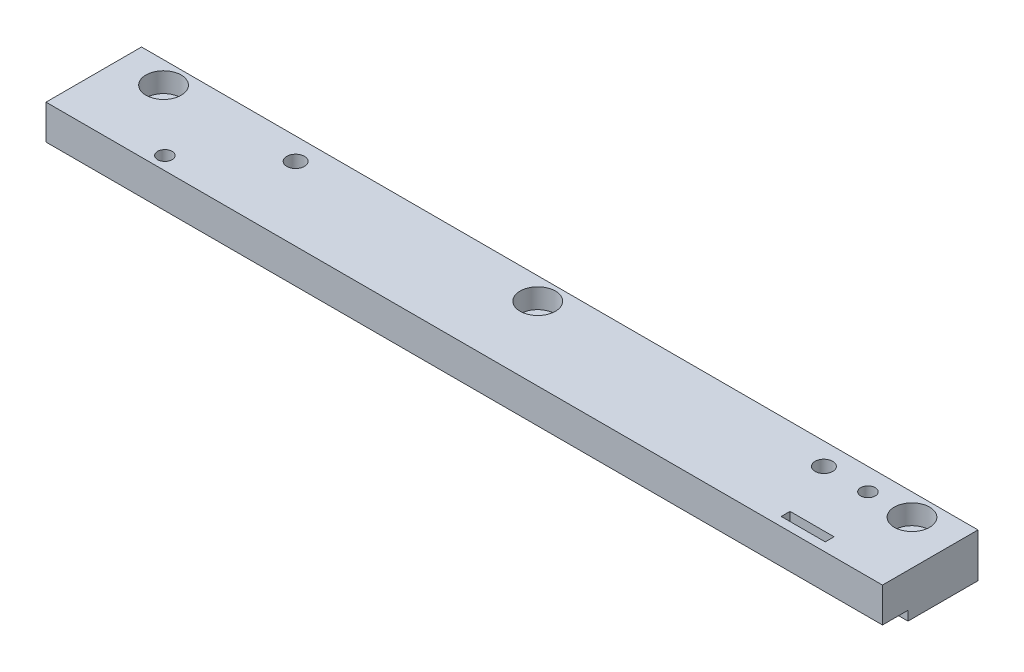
ISO-10303-21;
HEADER;
FILE_DESCRIPTION(('STEP AP214'),'2;1');
FILE_NAME('part.step','',(''),(''),'','','');
FILE_SCHEMA(('AUTOMOTIVE_DESIGN { 1 0 10303 214 1 1 1 1 }'));
ENDSEC;
DATA;
#1=APPLICATION_CONTEXT('core data for automotive mechanical design processes');
#2=APPLICATION_PROTOCOL_DEFINITION('international standard','automotive_design',2000,#1);
#3=PRODUCT_CONTEXT('',#1,'mechanical');
#4=PRODUCT('Part','Part','',(#3));
#5=PRODUCT_RELATED_PRODUCT_CATEGORY('part','',(#4));
#6=PRODUCT_DEFINITION_FORMATION('','',#4);
#7=PRODUCT_DEFINITION_CONTEXT('part definition',#1,'design');
#8=PRODUCT_DEFINITION('design','',#6,#7);
#9=PRODUCT_DEFINITION_SHAPE('','',#8);
#10=(LENGTH_UNIT() NAMED_UNIT(*) SI_UNIT(.MILLI.,.METRE.));
#11=(NAMED_UNIT(*) PLANE_ANGLE_UNIT() SI_UNIT($,.RADIAN.));
#12=(NAMED_UNIT(*) SI_UNIT($,.STERADIAN.) SOLID_ANGLE_UNIT());
#13=UNCERTAINTY_MEASURE_WITH_UNIT(LENGTH_MEASURE(1.E-05),#10,'distance_accuracy_value','');
#14=(GEOMETRIC_REPRESENTATION_CONTEXT(3) GLOBAL_UNCERTAINTY_ASSIGNED_CONTEXT((#13)) GLOBAL_UNIT_ASSIGNED_CONTEXT((#10,
#11,#12)) REPRESENTATION_CONTEXT('',''));
#15=CARTESIAN_POINT('',(0.,0.,0.));
#16=DIRECTION('',(0.,0.,1.));
#17=DIRECTION('',(1.,0.,0.));
#18=AXIS2_PLACEMENT_3D('',#15,#16,#17);
#19=CARTESIAN_POINT('',(180.000000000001,-11.7,5.));
#20=DIRECTION('',(0.,1.,0.));
#21=DIRECTION('',(0.,0.,1.));
#22=AXIS2_PLACEMENT_3D('',#19,#20,#21);
#23=CYLINDRICAL_SURFACE('',#22,2.25);
#24=CARTESIAN_POINT('',(180.000000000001,0.,5.));
#25=DIRECTION('',(0.,1.,0.));
#26=DIRECTION('',(0.,0.,1.));
#27=AXIS2_PLACEMENT_3D('',#24,#25,#26);
#28=CIRCLE('',#27,2.25);
#29=CARTESIAN_POINT('',(180.000000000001,0.,7.25));
#30=VERTEX_POINT('',#29);
#31=EDGE_CURVE('E151',#30,#30,#28,.T.);
#32=ORIENTED_EDGE('',*,*,#31,.F.);
#33=EDGE_LOOP('',(#32));
#34=FACE_BOUND('',#33,.T.);
#35=CARTESIAN_POINT('',(180.000000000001,5.5,5.));
#36=DIRECTION('',(0.,1.,0.));
#37=DIRECTION('',(0.,0.,1.));
#38=AXIS2_PLACEMENT_3D('',#35,#36,#37);
#39=CIRCLE('',#38,2.25);
#40=CARTESIAN_POINT('',(180.000000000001,5.5,7.25));
#41=VERTEX_POINT('',#40);
#42=EDGE_CURVE('E37',#41,#41,#39,.F.);
#43=ORIENTED_EDGE('',*,*,#42,.F.);
#44=EDGE_LOOP('',(#43));
#45=FACE_BOUND('',#44,.T.);
#46=ADVANCED_FACE('F33',(#34,#45),#23,.F.);
#47=CARTESIAN_POINT('',(95.,-11.7,5.));
#48=DIRECTION('',(0.,1.,0.));
#49=DIRECTION('',(0.,0.,1.));
#50=AXIS2_PLACEMENT_3D('',#47,#48,#49);
#51=CYLINDRICAL_SURFACE('',#50,2.25);
#52=CARTESIAN_POINT('',(95.,0.,5.));
#53=DIRECTION('',(0.,1.,0.));
#54=DIRECTION('',(0.,0.,1.));
#55=AXIS2_PLACEMENT_3D('',#52,#53,#54);
#56=CIRCLE('',#55,2.25);
#57=CARTESIAN_POINT('',(95.,0.,7.25));
#58=VERTEX_POINT('',#57);
#59=EDGE_CURVE('E154',#58,#58,#56,.T.);
#60=ORIENTED_EDGE('',*,*,#59,.F.);
#61=EDGE_LOOP('',(#60));
#62=FACE_BOUND('',#61,.T.);
#63=CARTESIAN_POINT('',(95.,5.5,5.));
#64=DIRECTION('',(0.,1.,0.));
#65=DIRECTION('',(0.,0.,1.));
#66=AXIS2_PLACEMENT_3D('',#63,#64,#65);
#67=CIRCLE('',#66,2.25);
#68=CARTESIAN_POINT('',(95.,5.5,7.25));
#69=VERTEX_POINT('',#68);
#70=EDGE_CURVE('E217',#69,#69,#67,.F.);
#71=ORIENTED_EDGE('',*,*,#70,.F.);
#72=EDGE_LOOP('',(#71));
#73=FACE_BOUND('',#72,.T.);
#74=ADVANCED_FACE('F264',(#62,#73),#51,.F.);
#75=CARTESIAN_POINT('',(10.,-11.7,5.));
#76=DIRECTION('',(0.,1.,0.));
#77=DIRECTION('',(0.,0.,1.));
#78=AXIS2_PLACEMENT_3D('',#75,#76,#77);
#79=CYLINDRICAL_SURFACE('',#78,2.25);
#80=CARTESIAN_POINT('',(10.,0.,5.));
#81=DIRECTION('',(0.,1.,0.));
#82=DIRECTION('',(0.,0.,1.));
#83=AXIS2_PLACEMENT_3D('',#80,#81,#82);
#84=CIRCLE('',#83,2.25);
#85=CARTESIAN_POINT('',(10.,0.,7.25));
#86=VERTEX_POINT('',#85);
#87=EDGE_CURVE('E157',#86,#86,#84,.T.);
#88=ORIENTED_EDGE('',*,*,#87,.F.);
#89=EDGE_LOOP('',(#88));
#90=FACE_BOUND('',#89,.T.);
#91=CARTESIAN_POINT('',(10.,5.5,5.));
#92=DIRECTION('',(0.,1.,0.));
#93=DIRECTION('',(0.,0.,1.));
#94=AXIS2_PLACEMENT_3D('',#91,#92,#93);
#95=CIRCLE('',#94,2.25);
#96=CARTESIAN_POINT('',(10.,5.5,7.25));
#97=VERTEX_POINT('',#96);
#98=EDGE_CURVE('E214',#97,#97,#95,.F.);
#99=ORIENTED_EDGE('',*,*,#98,.F.);
#100=EDGE_LOOP('',(#99));
#101=FACE_BOUND('',#100,.T.);
#102=ADVANCED_FACE('F270',(#90,#101),#79,.F.);
#103=CARTESIAN_POINT('',(0.,0.,21.7));
#104=DIRECTION('',(1.,0.,0.));
#105=DIRECTION('',(0.,0.,-1.));
#106=AXIS2_PLACEMENT_3D('',#103,#104,#105);
#107=PLANE('',#106);
#108=DIRECTION('',(0.,-1.,0.));
#109=VECTOR('',#108,1.);
#110=CARTESIAN_POINT('',(0.,0.,15.9000000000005));
#111=LINE('',#110,#109);
#112=CARTESIAN_POINT('',(0.,2.13999999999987,15.9000000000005));
#113=VERTEX_POINT('',#112);
#114=CARTESIAN_POINT('',(0.,0.,15.9000000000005));
#115=VERTEX_POINT('',#114);
#116=EDGE_CURVE('E164',#113,#115,#111,.T.);
#117=ORIENTED_EDGE('',*,*,#116,.F.);
#118=DIRECTION('',(0.,0.,-1.));
#119=VECTOR('',#118,1.);
#120=CARTESIAN_POINT('',(0.,2.13999999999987,21.6999999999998));
#121=LINE('',#120,#119);
#122=CARTESIAN_POINT('',(0.,2.13999999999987,21.6999999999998));
#123=VERTEX_POINT('',#122);
#124=EDGE_CURVE('E161',#123,#113,#121,.T.);
#125=ORIENTED_EDGE('',*,*,#124,.F.);
#126=DIRECTION('',(0.,-1.,0.));
#127=VECTOR('',#126,1.);
#128=CARTESIAN_POINT('',(0.,0.,21.7));
#129=LINE('',#128,#127);
#130=CARTESIAN_POINT('',(0.,10.,21.7));
#131=VERTEX_POINT('',#130);
#132=EDGE_CURVE('E179',#131,#123,#129,.T.);
#133=ORIENTED_EDGE('',*,*,#132,.F.);
#134=DIRECTION('',(0.,0.,-1.));
#135=VECTOR('',#134,1.);
#136=CARTESIAN_POINT('',(0.,10.,21.7));
#137=LINE('',#136,#135);
#138=CARTESIAN_POINT('',(0.,10.,0.));
#139=VERTEX_POINT('',#138);
#140=EDGE_CURVE('E187',#131,#139,#137,.T.);
#141=ORIENTED_EDGE('',*,*,#140,.T.);
#142=DIRECTION('',(0.,-1.,0.));
#143=VECTOR('',#142,1.);
#144=CARTESIAN_POINT('',(0.,0.,0.));
#145=LINE('',#144,#143);
#146=CARTESIAN_POINT('',(0.,0.,0.));
#147=VERTEX_POINT('',#146);
#148=EDGE_CURVE('E174',#139,#147,#145,.T.);
#149=ORIENTED_EDGE('',*,*,#148,.T.);
#150=DIRECTION('',(0.,0.,-1.));
#151=VECTOR('',#150,1.);
#152=CARTESIAN_POINT('',(0.,0.,21.7));
#153=LINE('',#152,#151);
#154=EDGE_CURVE('E203',#115,#147,#153,.T.);
#155=ORIENTED_EDGE('',*,*,#154,.F.);
#156=EDGE_LOOP('',(#117,#125,#133,#141,#149,#155));
#157=FACE_BOUND('',#156,.T.);
#158=ADVANCED_FACE('F35',(#157),#107,.F.);
#159=CARTESIAN_POINT('',(0.,0.,21.7));
#160=DIRECTION('',(0.,1.,0.));
#161=DIRECTION('',(0.,0.,1.));
#162=AXIS2_PLACEMENT_3D('',#159,#160,#161);
#163=PLANE('',#162);
#164=CARTESIAN_POINT('',(170.,0.,5.));
#165=DIRECTION('',(0.,1.,0.));
#166=DIRECTION('',(0.,0.,1.));
#167=AXIS2_PLACEMENT_3D('',#164,#165,#166);
#168=CIRCLE('',#167,1.65000000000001);
#169=CARTESIAN_POINT('',(170.,0.,6.65000000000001));
#170=VERTEX_POINT('',#169);
#171=EDGE_CURVE('E242',#170,#170,#168,.T.);
#172=ORIENTED_EDGE('',*,*,#171,.T.);
#173=EDGE_LOOP('',(#172));
#174=FACE_BOUND('',#173,.T.);
#175=CARTESIAN_POINT('',(160.,0.,5.));
#176=DIRECTION('',(0.,1.,0.));
#177=DIRECTION('',(0.,0.,1.));
#178=AXIS2_PLACEMENT_3D('',#175,#176,#177);
#179=CIRCLE('',#178,2.00000000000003);
#180=CARTESIAN_POINT('',(160.,0.,7.00000000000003));
#181=VERTEX_POINT('',#180);
#182=EDGE_CURVE('E142',#181,#181,#179,.T.);
#183=ORIENTED_EDGE('',*,*,#182,.T.);
#184=EDGE_LOOP('',(#183));
#185=FACE_BOUND('',#184,.T.);
#186=CARTESIAN_POINT('',(40.,0.,5.));
#187=DIRECTION('',(0.,1.,0.));
#188=DIRECTION('',(0.,0.,1.));
#189=AXIS2_PLACEMENT_3D('',#186,#187,#188);
#190=CIRCLE('',#189,2.00000000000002);
#191=CARTESIAN_POINT('',(40.,0.,7.00000000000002));
#192=VERTEX_POINT('',#191);
#193=EDGE_CURVE('E148',#192,#192,#190,.T.);
#194=ORIENTED_EDGE('',*,*,#193,.T.);
#195=EDGE_LOOP('',(#194));
#196=FACE_BOUND('',#195,.T.);
#197=ORIENTED_EDGE('',*,*,#31,.T.);
#198=EDGE_LOOP('',(#197));
#199=FACE_BOUND('',#198,.T.);
#200=ORIENTED_EDGE('',*,*,#59,.T.);
#201=EDGE_LOOP('',(#200));
#202=FACE_BOUND('',#201,.T.);
#203=ORIENTED_EDGE('',*,*,#87,.T.);
#204=EDGE_LOOP('',(#203));
#205=FACE_BOUND('',#204,.T.);
#206=DIRECTION('',(1.,0.,0.));
#207=VECTOR('',#206,1.);
#208=CARTESIAN_POINT('',(0.,0.,15.9000000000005));
#209=LINE('',#208,#207);
#210=CARTESIAN_POINT('',(190.,0.,15.9000000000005));
#211=VERTEX_POINT('',#210);
#212=EDGE_CURVE('E172',#115,#211,#209,.T.);
#213=ORIENTED_EDGE('',*,*,#212,.F.);
#214=ORIENTED_EDGE('',*,*,#154,.T.);
#215=DIRECTION('',(1.,0.,0.));
#216=VECTOR('',#215,1.);
#217=CARTESIAN_POINT('',(0.,0.,0.));
#218=LINE('',#217,#216);
#219=CARTESIAN_POINT('',(190.,0.,0.));
#220=VERTEX_POINT('',#219);
#221=EDGE_CURVE('E190',#147,#220,#218,.T.);
#222=ORIENTED_EDGE('',*,*,#221,.T.);
#223=DIRECTION('',(0.,0.,-1.));
#224=VECTOR('',#223,1.);
#225=CARTESIAN_POINT('',(190.,0.,21.7));
#226=LINE('',#225,#224);
#227=EDGE_CURVE('E201',#211,#220,#226,.T.);
#228=ORIENTED_EDGE('',*,*,#227,.F.);
#229=EDGE_LOOP('',(#213,#214,#222,#228));
#230=FACE_BOUND('',#229,.T.);
#231=ADVANCED_FACE('F246',(#174,#185,#196,#199,#202,#205,#230),#163,.F.);
#232=CARTESIAN_POINT('',(190.,0.,21.7));
#233=DIRECTION('',(-1.,0.,0.));
#234=DIRECTION('',(0.,0.,1.));
#235=AXIS2_PLACEMENT_3D('',#232,#233,#234);
#236=PLANE('',#235);
#237=DIRECTION('',(0.,-1.,0.));
#238=VECTOR('',#237,1.);
#239=CARTESIAN_POINT('',(190.,0.,15.9000000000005));
#240=LINE('',#239,#238);
#241=CARTESIAN_POINT('',(190.,2.13999999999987,15.9000000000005));
#242=VERTEX_POINT('',#241);
#243=EDGE_CURVE('E165',#242,#211,#240,.T.);
#244=ORIENTED_EDGE('',*,*,#243,.T.);
#245=ORIENTED_EDGE('',*,*,#227,.T.);
#246=DIRECTION('',(0.,1.,0.));
#247=VECTOR('',#246,1.);
#248=CARTESIAN_POINT('',(190.,0.,0.));
#249=LINE('',#248,#247);
#250=CARTESIAN_POINT('',(190.,10.,0.));
#251=VERTEX_POINT('',#250);
#252=EDGE_CURVE('E193',#220,#251,#249,.T.);
#253=ORIENTED_EDGE('',*,*,#252,.T.);
#254=DIRECTION('',(0.,0.,-1.));
#255=VECTOR('',#254,1.);
#256=CARTESIAN_POINT('',(190.,10.,21.7));
#257=LINE('',#256,#255);
#258=CARTESIAN_POINT('',(190.,10.,21.7));
#259=VERTEX_POINT('',#258);
#260=EDGE_CURVE('E198',#259,#251,#257,.T.);
#261=ORIENTED_EDGE('',*,*,#260,.F.);
#262=DIRECTION('',(0.,1.,0.));
#263=VECTOR('',#262,1.);
#264=CARTESIAN_POINT('',(190.,0.,21.7));
#265=LINE('',#264,#263);
#266=CARTESIAN_POINT('',(190.,2.13999999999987,21.7));
#267=VERTEX_POINT('',#266);
#268=EDGE_CURVE('E182',#267,#259,#265,.T.);
#269=ORIENTED_EDGE('',*,*,#268,.F.);
#270=DIRECTION('',(0.,0.,-1.));
#271=VECTOR('',#270,1.);
#272=CARTESIAN_POINT('',(190.,2.13999999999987,21.6999999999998));
#273=LINE('',#272,#271);
#274=EDGE_CURVE('E160',#267,#242,#273,.T.);
#275=ORIENTED_EDGE('',*,*,#274,.T.);
#276=EDGE_LOOP('',(#244,#245,#253,#261,#269,#275));
#277=FACE_BOUND('',#276,.T.);
#278=ADVANCED_FACE('F294',(#277),#236,.F.);
#279=CARTESIAN_POINT('',(0.,10.,21.7));
#280=DIRECTION('',(0.,0.,-1.));
#281=DIRECTION('',(-1.,0.,0.));
#282=AXIS2_PLACEMENT_3D('',#279,#280,#281);
#283=PLANE('',#282);
#284=DIRECTION('',(1.,0.,0.));
#285=VECTOR('',#284,1.);
#286=CARTESIAN_POINT('',(0.,2.13999999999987,21.6999999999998));
#287=LINE('',#286,#285);
#288=EDGE_CURVE('E167',#123,#267,#287,.T.);
#289=ORIENTED_EDGE('',*,*,#288,.T.);
#290=ORIENTED_EDGE('',*,*,#268,.T.);
#291=DIRECTION('',(-1.,0.,0.));
#292=VECTOR('',#291,1.);
#293=CARTESIAN_POINT('',(0.,10.,21.7));
#294=LINE('',#293,#292);
#295=EDGE_CURVE('E185',#259,#131,#294,.T.);
#296=ORIENTED_EDGE('',*,*,#295,.T.);
#297=ORIENTED_EDGE('',*,*,#132,.T.);
#298=EDGE_LOOP('',(#289,#290,#296,#297));
#299=FACE_BOUND('',#298,.T.);
#300=ADVANCED_FACE('F291',(#299),#283,.F.);
#301=CARTESIAN_POINT('',(0.,10.,21.7));
#302=DIRECTION('',(0.,-1.,0.));
#303=DIRECTION('',(0.,0.,-1.));
#304=AXIS2_PLACEMENT_3D('',#301,#302,#303);
#305=PLANE('',#304);
#306=CARTESIAN_POINT('',(180.000000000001,10.,5.));
#307=DIRECTION('',(0.,1.,0.));
#308=DIRECTION('',(0.,0.,1.));
#309=AXIS2_PLACEMENT_3D('',#306,#307,#308);
#310=CIRCLE('',#309,4.);
#311=CARTESIAN_POINT('',(180.000000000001,10.,9.00000000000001));
#312=VERTEX_POINT('',#311);
#313=EDGE_CURVE('E233',#312,#312,#310,.T.);
#314=ORIENTED_EDGE('',*,*,#313,.F.);
#315=EDGE_LOOP('',(#314));
#316=FACE_BOUND('',#315,.T.);
#317=CARTESIAN_POINT('',(95.,10.,5.));
#318=DIRECTION('',(0.,1.,0.));
#319=DIRECTION('',(0.,0.,1.));
#320=AXIS2_PLACEMENT_3D('',#317,#318,#319);
#321=CIRCLE('',#320,4.);
#322=CARTESIAN_POINT('',(95.,10.,9.00000000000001));
#323=VERTEX_POINT('',#322);
#324=EDGE_CURVE('E226',#323,#323,#321,.T.);
#325=ORIENTED_EDGE('',*,*,#324,.F.);
#326=EDGE_LOOP('',(#325));
#327=FACE_BOUND('',#326,.T.);
#328=CARTESIAN_POINT('',(10.,10.,5.));
#329=DIRECTION('',(0.,1.,0.));
#330=DIRECTION('',(0.,0.,1.));
#331=AXIS2_PLACEMENT_3D('',#328,#329,#330);
#332=CIRCLE('',#331,4.);
#333=CARTESIAN_POINT('',(10.,10.,9.));
#334=VERTEX_POINT('',#333);
#335=EDGE_CURVE('E219',#334,#334,#332,.T.);
#336=ORIENTED_EDGE('',*,*,#335,.F.);
#337=EDGE_LOOP('',(#336));
#338=FACE_BOUND('',#337,.T.);
#339=CARTESIAN_POINT('',(24.,10.,18.6999999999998));
#340=DIRECTION('',(0.,1.,0.));
#341=DIRECTION('',(0.,0.,1.));
#342=AXIS2_PLACEMENT_3D('',#339,#340,#341);
#343=CIRCLE('',#342,1.65);
#344=CARTESIAN_POINT('',(24.,10.,20.3499999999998));
#345=VERTEX_POINT('',#344);
#346=EDGE_CURVE('E213',#345,#345,#343,.T.);
#347=ORIENTED_EDGE('',*,*,#346,.F.);
#348=EDGE_LOOP('',(#347));
#349=FACE_BOUND('',#348,.T.);
#350=CARTESIAN_POINT('',(170.,10.,5.));
#351=DIRECTION('',(0.,1.,0.));
#352=DIRECTION('',(0.,0.,1.));
#353=AXIS2_PLACEMENT_3D('',#350,#351,#352);
#354=CIRCLE('',#353,1.65000000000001);
#355=CARTESIAN_POINT('',(170.,10.,6.65000000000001));
#356=VERTEX_POINT('',#355);
#357=EDGE_CURVE('E212',#356,#356,#354,.T.);
#358=ORIENTED_EDGE('',*,*,#357,.F.);
#359=EDGE_LOOP('',(#358));
#360=FACE_BOUND('',#359,.T.);
#361=DIRECTION('',(0.,0.,-1.));
#362=VECTOR('',#361,1.);
#363=CARTESIAN_POINT('',(175.,10.,19.6999999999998));
#364=LINE('',#363,#362);
#365=CARTESIAN_POINT('',(175.,10.,19.6999999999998));
#366=VERTEX_POINT('',#365);
#367=CARTESIAN_POINT('',(175.,10.,17.6999999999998));
#368=VERTEX_POINT('',#367);
#369=EDGE_CURVE('E123',#366,#368,#364,.T.);
#370=ORIENTED_EDGE('',*,*,#369,.F.);
#371=DIRECTION('',(1.,0.,0.));
#372=VECTOR('',#371,1.);
#373=CARTESIAN_POINT('',(165.,10.,19.6999999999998));
#374=LINE('',#373,#372);
#375=CARTESIAN_POINT('',(165.,10.,19.6999999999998));
#376=VERTEX_POINT('',#375);
#377=EDGE_CURVE('E50',#376,#366,#374,.T.);
#378=ORIENTED_EDGE('',*,*,#377,.F.);
#379=DIRECTION('',(0.,0.,1.));
#380=VECTOR('',#379,1.);
#381=CARTESIAN_POINT('',(165.,10.,19.6999999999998));
#382=LINE('',#381,#380);
#383=CARTESIAN_POINT('',(165.,10.,17.6999999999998));
#384=VERTEX_POINT('',#383);
#385=EDGE_CURVE('E130',#384,#376,#382,.T.);
#386=ORIENTED_EDGE('',*,*,#385,.F.);
#387=DIRECTION('',(-1.,0.,0.));
#388=VECTOR('',#387,1.);
#389=CARTESIAN_POINT('',(165.,10.,17.6999999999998));
#390=LINE('',#389,#388);
#391=EDGE_CURVE('E114',#368,#384,#390,.T.);
#392=ORIENTED_EDGE('',*,*,#391,.F.);
#393=EDGE_LOOP('',(#370,#378,#386,#392));
#394=FACE_BOUND('',#393,.T.);
#395=CARTESIAN_POINT('',(160.,10.,5.));
#396=DIRECTION('',(0.,1.,0.));
#397=DIRECTION('',(0.,0.,1.));
#398=AXIS2_PLACEMENT_3D('',#395,#396,#397);
#399=CIRCLE('',#398,2.00000000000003);
#400=CARTESIAN_POINT('',(160.,10.,7.00000000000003));
#401=VERTEX_POINT('',#400);
#402=EDGE_CURVE('E137',#401,#401,#399,.T.);
#403=ORIENTED_EDGE('',*,*,#402,.F.);
#404=EDGE_LOOP('',(#403));
#405=FACE_BOUND('',#404,.T.);
#406=CARTESIAN_POINT('',(40.,10.,5.));
#407=DIRECTION('',(0.,1.,0.));
#408=DIRECTION('',(0.,0.,1.));
#409=AXIS2_PLACEMENT_3D('',#406,#407,#408);
#410=CIRCLE('',#409,2.00000000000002);
#411=CARTESIAN_POINT('',(40.,10.,7.00000000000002));
#412=VERTEX_POINT('',#411);
#413=EDGE_CURVE('E145',#412,#412,#410,.T.);
#414=ORIENTED_EDGE('',*,*,#413,.F.);
#415=EDGE_LOOP('',(#414));
#416=FACE_BOUND('',#415,.T.);
#417=DIRECTION('',(-1.,0.,0.));
#418=VECTOR('',#417,1.);
#419=CARTESIAN_POINT('',(0.,10.,0.));
#420=LINE('',#419,#418);
#421=EDGE_CURVE('E183',#251,#139,#420,.T.);
#422=ORIENTED_EDGE('',*,*,#421,.T.);
#423=ORIENTED_EDGE('',*,*,#140,.F.);
#424=ORIENTED_EDGE('',*,*,#295,.F.);
#425=ORIENTED_EDGE('',*,*,#260,.T.);
#426=EDGE_LOOP('',(#422,#423,#424,#425));
#427=FACE_BOUND('',#426,.T.);
#428=ADVANCED_FACE('F127',(#316,#327,#338,#349,#360,#394,#405,#416,#427),#305,.F.);
#429=CARTESIAN_POINT('',(0.,10.,0.));
#430=DIRECTION('',(0.,0.,-1.));
#431=DIRECTION('',(-1.,0.,0.));
#432=AXIS2_PLACEMENT_3D('',#429,#430,#431);
#433=PLANE('',#432);
#434=ORIENTED_EDGE('',*,*,#148,.F.);
#435=ORIENTED_EDGE('',*,*,#421,.F.);
#436=ORIENTED_EDGE('',*,*,#252,.F.);
#437=ORIENTED_EDGE('',*,*,#221,.F.);
#438=EDGE_LOOP('',(#434,#435,#436,#437));
#439=FACE_BOUND('',#438,.T.);
#440=ADVANCED_FACE('F286',(#439),#433,.T.);
#441=CARTESIAN_POINT('',(0.,0.,15.9000000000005));
#442=DIRECTION('',(0.,0.,1.));
#443=DIRECTION('',(1.,0.,0.));
#444=AXIS2_PLACEMENT_3D('',#441,#442,#443);
#445=PLANE('',#444);
#446=ORIENTED_EDGE('',*,*,#243,.F.);
#447=DIRECTION('',(1.,0.,0.));
#448=VECTOR('',#447,1.);
#449=CARTESIAN_POINT('',(0.,2.13999999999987,15.9000000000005));
#450=LINE('',#449,#448);
#451=EDGE_CURVE('E175',#113,#242,#450,.T.);
#452=ORIENTED_EDGE('',*,*,#451,.F.);
#453=ORIENTED_EDGE('',*,*,#116,.T.);
#454=ORIENTED_EDGE('',*,*,#212,.T.);
#455=EDGE_LOOP('',(#446,#452,#453,#454));
#456=FACE_BOUND('',#455,.T.);
#457=ADVANCED_FACE('F282',(#456),#445,.T.);
#458=CARTESIAN_POINT('',(0.,2.13999999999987,21.6999999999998));
#459=DIRECTION('',(0.,-1.,0.));
#460=DIRECTION('',(0.,0.,-1.));
#461=AXIS2_PLACEMENT_3D('',#458,#459,#460);
#462=PLANE('',#461);
#463=CARTESIAN_POINT('',(24.,2.13999999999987,18.6999999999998));
#464=DIRECTION('',(0.,-1.,0.));
#465=DIRECTION('',(0.,0.,-1.));
#466=AXIS2_PLACEMENT_3D('',#463,#464,#465);
#467=CIRCLE('',#466,1.65);
#468=CARTESIAN_POINT('',(24.,2.13999999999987,17.0499999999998));
#469=VERTEX_POINT('',#468);
#470=EDGE_CURVE('E209',#469,#469,#467,.T.);
#471=ORIENTED_EDGE('',*,*,#470,.F.);
#472=EDGE_LOOP('',(#471));
#473=FACE_BOUND('',#472,.T.);
#474=DIRECTION('',(-1.,0.,0.));
#475=VECTOR('',#474,1.);
#476=CARTESIAN_POINT('',(0.,2.13999999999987,19.6999999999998));
#477=LINE('',#476,#475);
#478=CARTESIAN_POINT('',(175.,2.13999999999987,19.6999999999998));
#479=VERTEX_POINT('',#478);
#480=CARTESIAN_POINT('',(165.,2.13999999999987,19.6999999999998));
#481=VERTEX_POINT('',#480);
#482=EDGE_CURVE('E12',#479,#481,#477,.T.);
#483=ORIENTED_EDGE('',*,*,#482,.F.);
#484=DIRECTION('',(0.,0.,1.));
#485=VECTOR('',#484,1.);
#486=CARTESIAN_POINT('',(175.,2.13999999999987,21.6999999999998));
#487=LINE('',#486,#485);
#488=CARTESIAN_POINT('',(175.,2.13999999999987,17.6999999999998));
#489=VERTEX_POINT('',#488);
#490=EDGE_CURVE('E205',#489,#479,#487,.T.);
#491=ORIENTED_EDGE('',*,*,#490,.F.);
#492=DIRECTION('',(1.,0.,0.));
#493=VECTOR('',#492,1.);
#494=CARTESIAN_POINT('',(0.,2.13999999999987,17.6999999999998));
#495=LINE('',#494,#493);
#496=CARTESIAN_POINT('',(165.,2.13999999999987,17.6999999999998));
#497=VERTEX_POINT('',#496);
#498=EDGE_CURVE('E117',#497,#489,#495,.T.);
#499=ORIENTED_EDGE('',*,*,#498,.F.);
#500=DIRECTION('',(0.,0.,-1.));
#501=VECTOR('',#500,1.);
#502=CARTESIAN_POINT('',(165.,2.13999999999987,21.6999999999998));
#503=LINE('',#502,#501);
#504=EDGE_CURVE('E42',#481,#497,#503,.T.);
#505=ORIENTED_EDGE('',*,*,#504,.F.);
#506=EDGE_LOOP('',(#483,#491,#499,#505));
#507=FACE_BOUND('',#506,.T.);
#508=ORIENTED_EDGE('',*,*,#274,.F.);
#509=ORIENTED_EDGE('',*,*,#288,.F.);
#510=ORIENTED_EDGE('',*,*,#124,.T.);
#511=ORIENTED_EDGE('',*,*,#451,.T.);
#512=EDGE_LOOP('',(#508,#509,#510,#511));
#513=FACE_BOUND('',#512,.T.);
#514=ADVANCED_FACE('F285',(#473,#507,#513),#462,.T.);
#515=CARTESIAN_POINT('',(40.,-11.7,5.));
#516=DIRECTION('',(0.,1.,0.));
#517=DIRECTION('',(0.,0.,1.));
#518=AXIS2_PLACEMENT_3D('',#515,#516,#517);
#519=CYLINDRICAL_SURFACE('',#518,2.00000000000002);
#520=ORIENTED_EDGE('',*,*,#413,.T.);
#521=EDGE_LOOP('',(#520));
#522=FACE_BOUND('',#521,.T.);
#523=ORIENTED_EDGE('',*,*,#193,.F.);
#524=EDGE_LOOP('',(#523));
#525=FACE_BOUND('',#524,.T.);
#526=ADVANCED_FACE('F276',(#522,#525),#519,.F.);
#527=CARTESIAN_POINT('',(160.,-11.7,5.));
#528=DIRECTION('',(0.,1.,0.));
#529=DIRECTION('',(0.,0.,1.));
#530=AXIS2_PLACEMENT_3D('',#527,#528,#529);
#531=CYLINDRICAL_SURFACE('',#530,2.00000000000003);
#532=ORIENTED_EDGE('',*,*,#402,.T.);
#533=EDGE_LOOP('',(#532));
#534=FACE_BOUND('',#533,.T.);
#535=ORIENTED_EDGE('',*,*,#182,.F.);
#536=EDGE_LOOP('',(#535));
#537=FACE_BOUND('',#536,.T.);
#538=ADVANCED_FACE('F389',(#534,#537),#531,.F.);
#539=CARTESIAN_POINT('',(165.,-11.7,19.6999999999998));
#540=DIRECTION('',(0.,0.,1.));
#541=DIRECTION('',(1.,0.,0.));
#542=AXIS2_PLACEMENT_3D('',#539,#540,#541);
#543=PLANE('',#542);
#544=ORIENTED_EDGE('',*,*,#482,.T.);
#545=DIRECTION('',(0.,1.,0.));
#546=VECTOR('',#545,1.);
#547=CARTESIAN_POINT('',(165.,-11.7,19.6999999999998));
#548=LINE('',#547,#546);
#549=EDGE_CURVE('E135',#481,#376,#548,.T.);
#550=ORIENTED_EDGE('',*,*,#549,.T.);
#551=ORIENTED_EDGE('',*,*,#377,.T.);
#552=DIRECTION('',(0.,1.,0.));
#553=VECTOR('',#552,1.);
#554=CARTESIAN_POINT('',(175.,-11.7,19.6999999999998));
#555=LINE('',#554,#553);
#556=EDGE_CURVE('E120',#479,#366,#555,.T.);
#557=ORIENTED_EDGE('',*,*,#556,.F.);
#558=EDGE_LOOP('',(#544,#550,#551,#557));
#559=FACE_BOUND('',#558,.T.);
#560=ADVANCED_FACE('F380',(#559),#543,.F.);
#561=CARTESIAN_POINT('',(165.,-11.7,19.6999999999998));
#562=DIRECTION('',(-1.,0.,0.));
#563=DIRECTION('',(0.,0.,1.));
#564=AXIS2_PLACEMENT_3D('',#561,#562,#563);
#565=PLANE('',#564);
#566=ORIENTED_EDGE('',*,*,#504,.T.);
#567=DIRECTION('',(0.,1.,0.));
#568=VECTOR('',#567,1.);
#569=CARTESIAN_POINT('',(165.,-11.7,17.6999999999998));
#570=LINE('',#569,#568);
#571=EDGE_CURVE('E119',#497,#384,#570,.T.);
#572=ORIENTED_EDGE('',*,*,#571,.T.);
#573=ORIENTED_EDGE('',*,*,#385,.T.);
#574=ORIENTED_EDGE('',*,*,#549,.F.);
#575=EDGE_LOOP('',(#566,#572,#573,#574));
#576=FACE_BOUND('',#575,.T.);
#577=ADVANCED_FACE('F371',(#576),#565,.F.);
#578=CARTESIAN_POINT('',(165.,-11.7,17.6999999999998));
#579=DIRECTION('',(0.,0.,-1.));
#580=DIRECTION('',(-1.,0.,0.));
#581=AXIS2_PLACEMENT_3D('',#578,#579,#580);
#582=PLANE('',#581);
#583=ORIENTED_EDGE('',*,*,#498,.T.);
#584=DIRECTION('',(0.,1.,0.));
#585=VECTOR('',#584,1.);
#586=CARTESIAN_POINT('',(175.,-11.7,17.6999999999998));
#587=LINE('',#586,#585);
#588=EDGE_CURVE('E58',#489,#368,#587,.T.);
#589=ORIENTED_EDGE('',*,*,#588,.T.);
#590=ORIENTED_EDGE('',*,*,#391,.T.);
#591=ORIENTED_EDGE('',*,*,#571,.F.);
#592=EDGE_LOOP('',(#583,#589,#590,#591));
#593=FACE_BOUND('',#592,.T.);
#594=ADVANCED_FACE('F111',(#593),#582,.F.);
#595=CARTESIAN_POINT('',(175.,-11.7,19.6999999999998));
#596=DIRECTION('',(1.,0.,0.));
#597=DIRECTION('',(0.,0.,-1.));
#598=AXIS2_PLACEMENT_3D('',#595,#596,#597);
#599=PLANE('',#598);
#600=ORIENTED_EDGE('',*,*,#490,.T.);
#601=ORIENTED_EDGE('',*,*,#556,.T.);
#602=ORIENTED_EDGE('',*,*,#369,.T.);
#603=ORIENTED_EDGE('',*,*,#588,.F.);
#604=EDGE_LOOP('',(#600,#601,#602,#603));
#605=FACE_BOUND('',#604,.T.);
#606=ADVANCED_FACE('F124',(#605),#599,.F.);
#607=CARTESIAN_POINT('',(170.,-11.7,5.));
#608=DIRECTION('',(0.,1.,0.));
#609=DIRECTION('',(0.,0.,1.));
#610=AXIS2_PLACEMENT_3D('',#607,#608,#609);
#611=CYLINDRICAL_SURFACE('',#610,1.65000000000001);
#612=ORIENTED_EDGE('',*,*,#357,.T.);
#613=EDGE_LOOP('',(#612));
#614=FACE_BOUND('',#613,.T.);
#615=ORIENTED_EDGE('',*,*,#171,.F.);
#616=EDGE_LOOP('',(#615));
#617=FACE_BOUND('',#616,.T.);
#618=ADVANCED_FACE('F249',(#614,#617),#611,.F.);
#619=CARTESIAN_POINT('',(24.,-11.7,18.6999999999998));
#620=DIRECTION('',(0.,1.,0.));
#621=DIRECTION('',(0.,0.,1.));
#622=AXIS2_PLACEMENT_3D('',#619,#620,#621);
#623=CYLINDRICAL_SURFACE('',#622,1.65);
#624=ORIENTED_EDGE('',*,*,#470,.T.);
#625=EDGE_LOOP('',(#624));
#626=FACE_BOUND('',#625,.T.);
#627=ORIENTED_EDGE('',*,*,#346,.T.);
#628=EDGE_LOOP('',(#627));
#629=FACE_BOUND('',#628,.T.);
#630=ADVANCED_FACE('F251',(#626,#629),#623,.F.);
#631=CARTESIAN_POINT('',(10.,5.5,5.));
#632=DIRECTION('',(0.,1.,0.));
#633=DIRECTION('',(0.,0.,1.));
#634=AXIS2_PLACEMENT_3D('',#631,#632,#633);
#635=PLANE('',#634);
#636=CARTESIAN_POINT('',(10.,5.5,5.));
#637=DIRECTION('',(0.,1.,0.));
#638=DIRECTION('',(0.,0.,1.));
#639=AXIS2_PLACEMENT_3D('',#636,#637,#638);
#640=CIRCLE('',#639,4.);
#641=CARTESIAN_POINT('',(10.,5.5,9.));
#642=VERTEX_POINT('',#641);
#643=EDGE_CURVE('E216',#642,#642,#640,.T.);
#644=ORIENTED_EDGE('',*,*,#643,.T.);
#645=EDGE_LOOP('',(#644));
#646=FACE_BOUND('',#645,.T.);
#647=ORIENTED_EDGE('',*,*,#98,.T.);
#648=EDGE_LOOP('',(#647));
#649=FACE_BOUND('',#648,.T.);
#650=ADVANCED_FACE('F258',(#646,#649),#635,.T.);
#651=CARTESIAN_POINT('',(10.,5.5,5.));
#652=DIRECTION('',(0.,1.,0.));
#653=DIRECTION('',(0.,0.,1.));
#654=AXIS2_PLACEMENT_3D('',#651,#652,#653);
#655=CYLINDRICAL_SURFACE('',#654,4.);
#656=ORIENTED_EDGE('',*,*,#643,.F.);
#657=EDGE_LOOP('',(#656));
#658=FACE_BOUND('',#657,.T.);
#659=ORIENTED_EDGE('',*,*,#335,.T.);
#660=EDGE_LOOP('',(#659));
#661=FACE_BOUND('',#660,.T.);
#662=ADVANCED_FACE('F449',(#658,#661),#655,.F.);
#663=CARTESIAN_POINT('',(95.,5.5,5.));
#664=DIRECTION('',(0.,1.,0.));
#665=DIRECTION('',(0.,0.,1.));
#666=AXIS2_PLACEMENT_3D('',#663,#664,#665);
#667=PLANE('',#666);
#668=CARTESIAN_POINT('',(95.,5.5,5.));
#669=DIRECTION('',(0.,1.,0.));
#670=DIRECTION('',(0.,0.,1.));
#671=AXIS2_PLACEMENT_3D('',#668,#669,#670);
#672=CIRCLE('',#671,4.);
#673=CARTESIAN_POINT('',(95.,5.5,9.00000000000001));
#674=VERTEX_POINT('',#673);
#675=EDGE_CURVE('E220',#674,#674,#672,.T.);
#676=ORIENTED_EDGE('',*,*,#675,.T.);
#677=EDGE_LOOP('',(#676));
#678=FACE_BOUND('',#677,.T.);
#679=ORIENTED_EDGE('',*,*,#70,.T.);
#680=EDGE_LOOP('',(#679));
#681=FACE_BOUND('',#680,.T.);
#682=ADVANCED_FACE('F459',(#678,#681),#667,.T.);
#683=CARTESIAN_POINT('',(95.,5.5,5.));
#684=DIRECTION('',(0.,1.,0.));
#685=DIRECTION('',(0.,0.,1.));
#686=AXIS2_PLACEMENT_3D('',#683,#684,#685);
#687=CYLINDRICAL_SURFACE('',#686,4.);
#688=ORIENTED_EDGE('',*,*,#675,.F.);
#689=EDGE_LOOP('',(#688));
#690=FACE_BOUND('',#689,.T.);
#691=ORIENTED_EDGE('',*,*,#324,.T.);
#692=EDGE_LOOP('',(#691));
#693=FACE_BOUND('',#692,.T.);
#694=ADVANCED_FACE('F469',(#690,#693),#687,.F.);
#695=CARTESIAN_POINT('',(180.000000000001,5.5,5.));
#696=DIRECTION('',(0.,1.,0.));
#697=DIRECTION('',(0.,0.,1.));
#698=AXIS2_PLACEMENT_3D('',#695,#696,#697);
#699=PLANE('',#698);
#700=CARTESIAN_POINT('',(180.000000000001,5.5,5.));
#701=DIRECTION('',(0.,1.,0.));
#702=DIRECTION('',(0.,0.,1.));
#703=AXIS2_PLACEMENT_3D('',#700,#701,#702);
#704=CIRCLE('',#703,4.);
#705=CARTESIAN_POINT('',(180.000000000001,5.5,9.00000000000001));
#706=VERTEX_POINT('',#705);
#707=EDGE_CURVE('E505',#706,#706,#704,.T.);
#708=ORIENTED_EDGE('',*,*,#707,.T.);
#709=EDGE_LOOP('',(#708));
#710=FACE_BOUND('',#709,.T.);
#711=ORIENTED_EDGE('',*,*,#42,.T.);
#712=EDGE_LOOP('',(#711));
#713=FACE_BOUND('',#712,.T.);
#714=ADVANCED_FACE('F478',(#710,#713),#699,.T.);
#715=CARTESIAN_POINT('',(180.000000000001,5.5,5.));
#716=DIRECTION('',(0.,1.,0.));
#717=DIRECTION('',(0.,0.,1.));
#718=AXIS2_PLACEMENT_3D('',#715,#716,#717);
#719=CYLINDRICAL_SURFACE('',#718,4.);
#720=ORIENTED_EDGE('',*,*,#707,.F.);
#721=EDGE_LOOP('',(#720));
#722=FACE_BOUND('',#721,.T.);
#723=ORIENTED_EDGE('',*,*,#313,.T.);
#724=EDGE_LOOP('',(#723));
#725=FACE_BOUND('',#724,.T.);
#726=ADVANCED_FACE('F488',(#722,#725),#719,.F.);
#727=CLOSED_SHELL('',(#46,#74,#102,#158,#231,#278,#300,#428,#440,#457,#514,#526,#538,#560,#577,
#594,#606,#618,#630,#650,#662,#682,#694,#714,#726));
#728=MANIFOLD_SOLID_BREP('B2',#727);
#729=ADVANCED_BREP_SHAPE_REPRESENTATION('',(#18,#728),#14);
#730=SHAPE_DEFINITION_REPRESENTATION(#9,#729);
ENDSEC;
END-ISO-10303-21;
